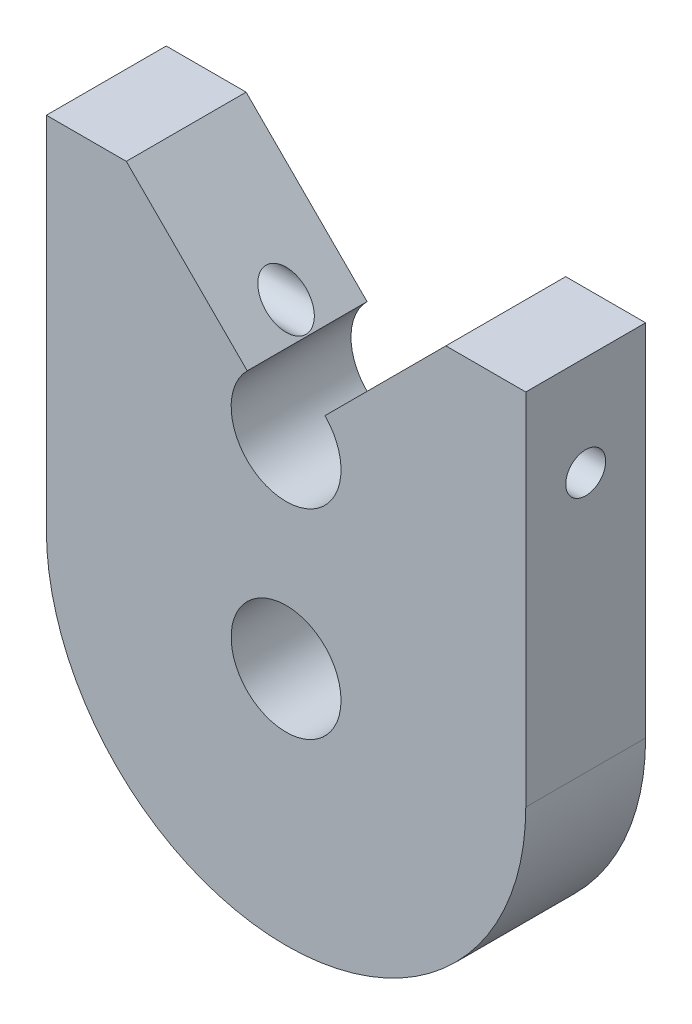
from build123d import *

# Parameters (mm, degrees)
SKETCH2_R      = 2.75
EXTRUDE1_DEPTH = 6
SKETCH3_R      = 1
EXTRUDE2_DEPTH = 31.594117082


with BuildPart() as part:
    # Sketch2 → Extrude1 (new body)
    with BuildSketch(Plane.XY):
        with BuildLine():
            Line((12, 0), (12, 18))
            Line((12, 18), (8, 18))
            Line((8, 18), (1.944543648, 11.944543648))
            ThreePointArc((1.944543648, 11.944543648), (0, 7.25), (-1.944543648, 11.944543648))
            Line((-1.944543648, 11.944543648), (-8, 18))
            Line((-8, 18), (-12, 18))
            Line((-12, 18), (-12, 0))
            ThreePointArc((-12, 0), (0, -12), (12, 0))
        make_face()
        Circle(SKETCH2_R, mode=Mode.SUBTRACT)
    extrude(amount=EXTRUDE1_DEPTH)

    # Sketch3 → Extrude2 (cut, through all)
    with BuildSketch(Plane(origin=(12, 0, 0), x_dir=(0, 0, -1), z_dir=(1, 0, 0))):
        with Locations((-3, 13)):
            Circle(SKETCH3_R)
    extrude(amount=-EXTRUDE2_DEPTH, mode=Mode.SUBTRACT)


solid = part.part
